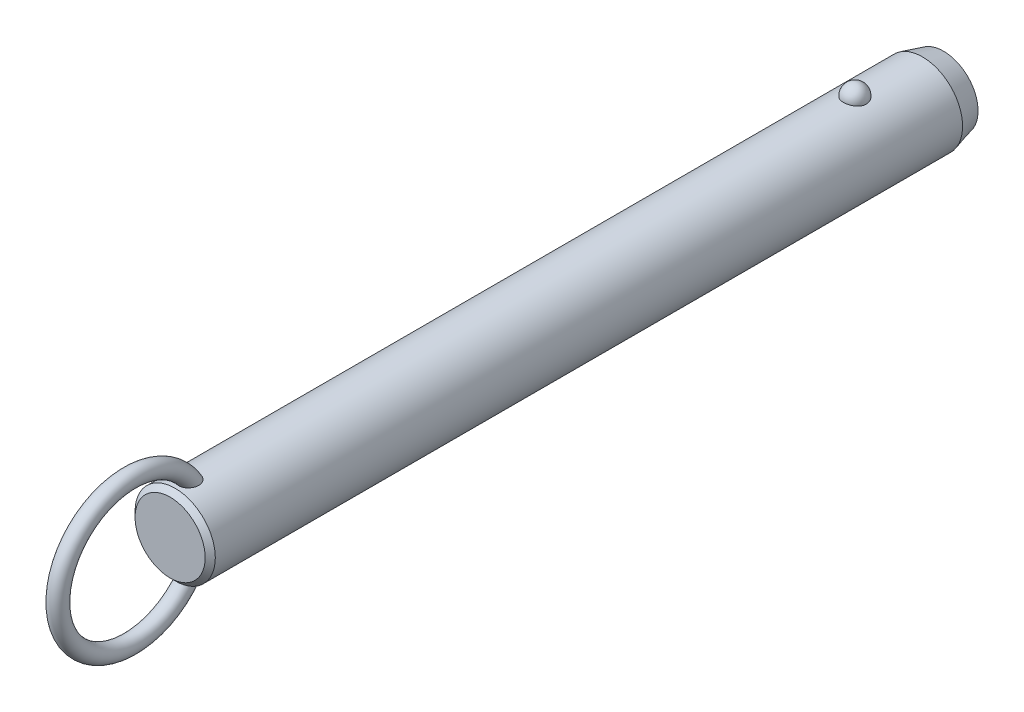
ISO-10303-21;
HEADER;
FILE_DESCRIPTION(('STEP AP214'),'2;1');
FILE_NAME('part.step','',(''),(''),'','','');
FILE_SCHEMA(('AUTOMOTIVE_DESIGN { 1 0 10303 214 1 1 1 1 }'));
ENDSEC;
DATA;
#1=APPLICATION_CONTEXT('core data for automotive mechanical design processes');
#2=APPLICATION_PROTOCOL_DEFINITION('international standard','automotive_design',2000,#1);
#3=PRODUCT_CONTEXT('',#1,'mechanical');
#4=PRODUCT('Part','Part','',(#3));
#5=PRODUCT_RELATED_PRODUCT_CATEGORY('part','',(#4));
#6=PRODUCT_DEFINITION_FORMATION('','',#4);
#7=PRODUCT_DEFINITION_CONTEXT('part definition',#1,'design');
#8=PRODUCT_DEFINITION('design','',#6,#7);
#9=PRODUCT_DEFINITION_SHAPE('','',#8);
#10=(LENGTH_UNIT() NAMED_UNIT(*) SI_UNIT(.MILLI.,.METRE.));
#11=(NAMED_UNIT(*) PLANE_ANGLE_UNIT() SI_UNIT($,.RADIAN.));
#12=(NAMED_UNIT(*) SI_UNIT($,.STERADIAN.) SOLID_ANGLE_UNIT());
#13=UNCERTAINTY_MEASURE_WITH_UNIT(LENGTH_MEASURE(1.E-05),#10,'distance_accuracy_value','');
#14=(GEOMETRIC_REPRESENTATION_CONTEXT(3) GLOBAL_UNCERTAINTY_ASSIGNED_CONTEXT((#13)) GLOBAL_UNIT_ASSIGNED_CONTEXT((#10,
#11,#12)) REPRESENTATION_CONTEXT('',''));
#15=CARTESIAN_POINT('',(0.,0.,0.));
#16=DIRECTION('',(0.,0.,1.));
#17=DIRECTION('',(1.,0.,0.));
#18=AXIS2_PLACEMENT_3D('',#15,#16,#17);
#19=CARTESIAN_POINT('',(0.,0.,149.9));
#20=DIRECTION('',(0.,0.,-1.));
#21=DIRECTION('',(-1.,0.,0.));
#22=AXIS2_PLACEMENT_3D('',#19,#20,#21);
#23=CYLINDRICAL_SURFACE('',#22,9.5);
#24=CARTESIAN_POINT('',(2.67259918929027,9.11631578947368,-2.70000000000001));
#25=CARTESIAN_POINT('',(2.6725968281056,9.11631786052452,-2.54909854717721));
#26=CARTESIAN_POINT('',(2.66030567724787,9.11994722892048,-2.39816735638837));
#27=CARTESIAN_POINT('',(2.6114347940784,9.13405924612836,-2.10058568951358));
#28=CARTESIAN_POINT('',(2.57484658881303,9.14454428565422,-1.95393672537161));
#29=CARTESIAN_POINT('',(2.47830875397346,9.17117631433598,-1.66916069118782));
#30=CARTESIAN_POINT('',(2.41836936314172,9.18732082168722,-1.53102991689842));
#31=CARTESIAN_POINT('',(2.27661331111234,9.22346780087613,-1.26705393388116));
#32=CARTESIAN_POINT('',(2.19479699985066,9.24347021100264,-1.14120852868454));
#33=CARTESIAN_POINT('',(2.01085282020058,9.28522401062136,-0.904632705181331));
#34=CARTESIAN_POINT('',(1.90862396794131,9.30698376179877,-0.793982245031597));
#35=CARTESIAN_POINT('',(1.6867437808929,9.34973971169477,-0.591607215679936));
#36=CARTESIAN_POINT('',(1.56709244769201,9.37073591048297,-0.499882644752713));
#37=CARTESIAN_POINT('',(1.31393976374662,9.40956370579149,-0.338167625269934));
#38=CARTESIAN_POINT('',(1.18048026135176,9.42740444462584,-0.268113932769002));
#39=CARTESIAN_POINT('',(0.903154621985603,9.45799906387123,-0.151390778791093));
#40=CARTESIAN_POINT('',(0.759289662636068,9.47075351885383,-0.104718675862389));
#41=CARTESIAN_POINT('',(0.468074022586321,9.48956256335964,-0.0367633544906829));
#42=CARTESIAN_POINT('',(0.320836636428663,9.49573643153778,-0.0150275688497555));
#43=CARTESIAN_POINT('',(0.0246714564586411,9.50112183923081,0.00396199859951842));
#44=CARTESIAN_POINT('',(-0.124256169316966,9.50033406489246,0.00121819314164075));
#45=CARTESIAN_POINT('',(-0.417264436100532,9.4919475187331,-0.0284441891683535));
#46=CARTESIAN_POINT('',(-0.56138413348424,9.48444885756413,-0.0550074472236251));
#47=CARTESIAN_POINT('',(-0.842986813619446,9.46357853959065,-0.131064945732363));
#48=CARTESIAN_POINT('',(-0.980469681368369,9.450206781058,-0.180559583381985));
#49=CARTESIAN_POINT('',(-1.24585005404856,9.41890822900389,-0.301476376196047));
#50=CARTESIAN_POINT('',(-1.37368611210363,9.40095498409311,-0.373026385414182));
#51=CARTESIAN_POINT('',(-1.61552738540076,9.36242964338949,-0.536025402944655));
#52=CARTESIAN_POINT('',(-1.72953116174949,9.34185727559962,-0.627476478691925));
#53=CARTESIAN_POINT('',(-1.9429225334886,9.29984568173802,-0.829844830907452));
#54=CARTESIAN_POINT('',(-2.04198021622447,9.27839736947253,-0.94110821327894));
#55=CARTESIAN_POINT('',(-2.22026460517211,9.23735994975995,-1.17883414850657));
#56=CARTESIAN_POINT('',(-2.29948985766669,9.21777097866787,-1.30529781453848));
#57=CARTESIAN_POINT('',(-2.43697287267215,9.18238994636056,-1.57158566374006));
#58=CARTESIAN_POINT('',(-2.49497068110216,9.16664569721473,-1.71155057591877));
#59=CARTESIAN_POINT('',(-2.5872073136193,9.14104303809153,-1.99961197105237));
#60=CARTESIAN_POINT('',(-2.62144683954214,9.13118445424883,-2.14770821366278));
#61=CARTESIAN_POINT('',(-2.66521466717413,9.11850622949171,-2.44715424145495));
#62=CARTESIAN_POINT('',(-2.67484831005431,9.11565658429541,-2.59848735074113));
#63=CARTESIAN_POINT('',(-2.66946735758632,9.11723375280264,-2.90067317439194));
#64=CARTESIAN_POINT('',(-2.65445345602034,9.12166036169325,-3.05152590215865));
#65=CARTESIAN_POINT('',(-2.60029711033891,9.13724422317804,-3.34766110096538));
#66=CARTESIAN_POINT('',(-2.56127978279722,9.14836656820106,-3.49296833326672));
#67=CARTESIAN_POINT('',(-2.46018844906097,9.17606676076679,-3.77477535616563));
#68=CARTESIAN_POINT('',(-2.39811349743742,9.1926448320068,-3.9112747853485));
#69=CARTESIAN_POINT('',(-2.25202303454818,9.22952198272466,-4.17244273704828));
#70=CARTESIAN_POINT('',(-2.16788714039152,9.24984129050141,-4.29704106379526));
#71=CARTESIAN_POINT('',(-1.9799408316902,9.29188255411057,-4.53013066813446));
#72=CARTESIAN_POINT('',(-1.87612963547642,9.31360456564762,-4.63862130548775));
#73=CARTESIAN_POINT('',(-1.65105429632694,9.35612959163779,-4.8369029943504));
#74=CARTESIAN_POINT('',(-1.52972405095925,9.37692871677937,-4.92661991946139));
#75=CARTESIAN_POINT('',(-1.27318250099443,9.41518970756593,-5.08429106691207));
#76=CARTESIAN_POINT('',(-1.13797219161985,9.432651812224,-5.15224684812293));
#77=CARTESIAN_POINT('',(-0.859280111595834,9.46208255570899,-5.26371827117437));
#78=CARTESIAN_POINT('',(-0.715925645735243,9.47411833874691,-5.30753421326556));
#79=CARTESIAN_POINT('',(-0.423550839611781,9.4916822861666,-5.37076321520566));
#80=CARTESIAN_POINT('',(-0.2745312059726,9.49721125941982,-5.39017930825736));
#81=CARTESIAN_POINT('',(0.0218446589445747,9.50110860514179,-5.40390587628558));
#82=CARTESIAN_POINT('',(0.16917707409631,9.49961381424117,-5.39869609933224));
#83=CARTESIAN_POINT('',(0.460808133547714,9.48993906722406,-5.36441955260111));
#84=CARTESIAN_POINT('',(0.605106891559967,9.48175936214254,-5.33535367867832));
#85=CARTESIAN_POINT('',(0.886027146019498,9.4596376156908,-5.25435587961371));
#86=CARTESIAN_POINT('',(1.02267710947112,9.44571881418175,-5.20251612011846));
#87=CARTESIAN_POINT('',(1.28523827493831,9.41358993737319,-5.07741549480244));
#88=CARTESIAN_POINT('',(1.41114877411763,9.39537958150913,-5.00415322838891));
#89=CARTESIAN_POINT('',(1.65085227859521,9.3562644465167,-4.83684599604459));
#90=CARTESIAN_POINT('',(1.76442346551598,9.33532178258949,-4.74249218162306));
#91=CARTESIAN_POINT('',(1.97425672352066,9.29321198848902,-4.53620389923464));
#92=CARTESIAN_POINT('',(2.07051582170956,9.27204482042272,-4.42426641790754));
#93=CARTESIAN_POINT('',(2.24490086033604,9.23139221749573,-4.18363183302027));
#94=CARTESIAN_POINT('',(2.32267019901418,9.21194380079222,-4.05466990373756));
#95=CARTESIAN_POINT('',(2.45584092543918,9.1773419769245,-3.78517836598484));
#96=CARTESIAN_POINT('',(2.5112497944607,9.16218713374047,-3.64465264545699));
#97=CARTESIAN_POINT('',(2.59380876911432,9.13913522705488,-3.37104301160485));
#98=CARTESIAN_POINT('',(2.62330266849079,9.13064624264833,-3.23871053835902));
#99=CARTESIAN_POINT('',(2.66269870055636,9.11923566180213,-2.97092664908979));
#100=CARTESIAN_POINT('',(2.67260130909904,9.11631393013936,-2.83547530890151));
#101=CARTESIAN_POINT('',(2.67259918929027,9.11631578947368,-2.70000000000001));
#102=B_SPLINE_CURVE_WITH_KNOTS('',3,(#24,#25,#26,#27,#28,#29,#30,#31,#32,#33,#34,#35,#36,#37,
#38,#39,#40,#41,#42,#43,#44,#45,#46,#47,#48,#49,#50,#51,#52,#53,#54,#55,#56,#57,#58,#59,#60,#61,
#62,#63,#64,#65,#66,#67,#68,#69,#70,#71,#72,#73,#74,#75,#76,#77,#78,#79,#80,#81,#82,#83,#84,#85,
#86,#87,#88,#89,#90,#91,#92,#93,#94,#95,#96,#97,#98,#99,#100,#101),.UNSPECIFIED.,.T.,.F.,(4,2,2,
2,2,2,2,2,2,2,2,2,2,2,2,2,2,2,2,2,2,2,2,2,2,2,2,2,2,2,2,2,2,2,2,2,2,2,4),(0.,0.452217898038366,
0.904593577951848,1.35677112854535,1.80894144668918,2.26340676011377,2.71787203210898,
3.17099820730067,3.62407318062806,4.0687883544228,4.51345969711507,4.95160616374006,
5.38976021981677,5.83050358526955,6.27129275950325,6.72071308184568,7.17016633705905,
7.62495278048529,8.07972578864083,8.53254856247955,8.98535859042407,9.43582813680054,
9.88631615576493,10.3393155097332,10.7923328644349,11.2471065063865,11.7018475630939,
12.150795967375,12.599688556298,13.0398725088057,13.4800399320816,13.9184421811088,
14.3568730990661,14.802202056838,15.2476074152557,15.7010097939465,16.1542603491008,
16.5602594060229,16.966248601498),.UNSPECIFIED.);
#103=CARTESIAN_POINT('',(2.67259918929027,9.11631578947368,-2.70000000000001));
#104=VERTEX_POINT('',#103);
#105=EDGE_CURVE('E41',#104,#104,#102,.T.);
#106=ORIENTED_EDGE('',*,*,#105,.T.);
#107=EDGE_LOOP('',(#106));
#108=FACE_BOUND('',#107,.T.);
#109=CARTESIAN_POINT('',(0.,0.,158.22));
#110=DIRECTION('',(0.,0.,1.));
#111=DIRECTION('',(1.,0.,0.));
#112=AXIS2_PLACEMENT_3D('',#109,#110,#111);
#113=CIRCLE('',#112,9.5);
#114=CARTESIAN_POINT('',(9.5,0.,158.22));
#115=VERTEX_POINT('',#114);
#116=EDGE_CURVE('E10',#115,#115,#113,.F.);
#117=ORIENTED_EDGE('',*,*,#116,.T.);
#118=EDGE_LOOP('',(#117));
#119=FACE_BOUND('',#118,.T.);
#120=CARTESIAN_POINT('',(-0.697062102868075,-9.47439269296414,152.567808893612));
#121=CARTESIAN_POINT('',(-0.799579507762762,-9.46685146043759,152.607482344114));
#122=CARTESIAN_POINT('',(-0.89857563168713,-9.45788043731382,152.6559309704));
#123=CARTESIAN_POINT('',(-1.08670047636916,-9.43811593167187,152.768868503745));
#124=CARTESIAN_POINT('',(-1.17583204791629,-9.42732297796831,152.833352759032));
#125=CARTESIAN_POINT('',(-1.34179806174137,-9.40513672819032,152.976209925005));
#126=CARTESIAN_POINT('',(-1.41865133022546,-9.39374438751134,153.054561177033));
#127=CARTESIAN_POINT('',(-1.5586004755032,-9.37154196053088,153.222752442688));
#128=CARTESIAN_POINT('',(-1.62169476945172,-9.3607319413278,153.31259377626));
#129=CARTESIAN_POINT('',(-1.73527695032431,-9.34035749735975,153.504500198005));
#130=CARTESIAN_POINT('',(-1.78522266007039,-9.33085270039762,153.606891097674));
#131=CARTESIAN_POINT('',(-1.86924997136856,-9.3143834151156,153.818148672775));
#132=CARTESIAN_POINT('',(-1.90332570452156,-9.30741986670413,153.927017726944));
#133=CARTESIAN_POINT('',(-1.95893603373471,-9.29588482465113,154.160473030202));
#134=CARTESIAN_POINT('',(-1.97872420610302,-9.29165182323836,154.285489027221));
#135=CARTESIAN_POINT('',(-2.00062129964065,-9.28695978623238,154.537080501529));
#136=CARTESIAN_POINT('',(-2.00272284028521,-9.28650232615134,154.663656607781));
#137=CARTESIAN_POINT('',(-1.98958876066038,-9.28932750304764,154.936815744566));
#138=CARTESIAN_POINT('',(-1.97143366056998,-9.2932400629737,155.083251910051));
#139=CARTESIAN_POINT('',(-1.91479925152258,-9.30507151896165,155.372062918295));
#140=CARTESIAN_POINT('',(-1.87629122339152,-9.31299607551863,155.514431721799));
#141=CARTESIAN_POINT('',(-1.7722568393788,-9.33340232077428,155.815172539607));
#142=CARTESIAN_POINT('',(-1.70334898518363,-9.34641636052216,155.972369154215));
#143=CARTESIAN_POINT('',(-1.58111062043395,-9.36759153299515,156.197517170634));
#144=CARTESIAN_POINT('',(-1.53721459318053,-9.37492619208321,156.270796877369));
#145=CARTESIAN_POINT('',(-1.44302631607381,-9.38988566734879,156.41307405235));
#146=CARTESIAN_POINT('',(-1.39273721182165,-9.39751033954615,156.482073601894));
#147=CARTESIAN_POINT('',(-1.26775962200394,-9.41530678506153,156.636983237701));
#148=CARTESIAN_POINT('',(-1.19052326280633,-9.42548108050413,156.720871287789));
#149=CARTESIAN_POINT('',(-1.02420241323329,-9.44499825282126,156.876008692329));
#150=CARTESIAN_POINT('',(-0.935139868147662,-9.45434261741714,156.947280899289));
#151=CARTESIAN_POINT('',(-0.766610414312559,-9.46930670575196,157.058695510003));
#152=CARTESIAN_POINT('',(-0.689439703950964,-9.47529223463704,157.102235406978));
#153=CARTESIAN_POINT('',(-0.528942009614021,-9.48560294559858,157.17631336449));
#154=CARTESIAN_POINT('',(-0.445620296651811,-9.48992953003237,157.206862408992));
#155=CARTESIAN_POINT('',(-0.273901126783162,-9.49644161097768,157.252579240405));
#156=CARTESIAN_POINT('',(-0.18546574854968,-9.49860811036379,157.26761059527));
#157=CARTESIAN_POINT('',(-0.00734541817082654,-9.5004135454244,157.280149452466));
#158=CARTESIAN_POINT('',(0.082338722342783,-9.50005405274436,157.277667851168));
#159=CARTESIAN_POINT('',(0.247679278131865,-9.49708301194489,157.256995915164));
#160=CARTESIAN_POINT('',(0.323620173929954,-9.49477609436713,157.240930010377));
#161=CARTESIAN_POINT('',(0.471981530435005,-9.48855917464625,157.197172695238));
#162=CARTESIAN_POINT('',(0.544400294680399,-9.48464840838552,157.169475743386));
#163=CARTESIAN_POINT('',(0.708947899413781,-9.47398336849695,157.09280266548));
#164=CARTESIAN_POINT('',(0.799149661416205,-9.46671310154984,157.039774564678));
#165=CARTESIAN_POINT('',(0.969783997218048,-9.45076225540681,156.919973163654));
#166=CARTESIAN_POINT('',(1.05019415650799,-9.44207854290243,156.853169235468));
#167=CARTESIAN_POINT('',(1.23092343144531,-9.42051459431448,156.680759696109));
#168=CARTESIAN_POINT('',(1.32652499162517,-9.40733378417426,156.57026193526));
#169=CARTESIAN_POINT('',(1.49893121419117,-9.38140745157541,156.335561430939));
#170=CARTESIAN_POINT('',(1.57571616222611,-9.36866239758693,156.211344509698));
#171=CARTESIAN_POINT('',(1.71285426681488,-9.34457644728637,155.949389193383));
#172=CARTESIAN_POINT('',(1.77266365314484,-9.33328726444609,155.81136233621));
#173=CARTESIAN_POINT('',(1.87239208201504,-9.31379209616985,155.528051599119));
#174=CARTESIAN_POINT('',(1.91230158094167,-9.30558759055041,155.382764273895));
#175=CARTESIAN_POINT('',(1.97604189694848,-9.29228394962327,155.062028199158));
#176=CARTESIAN_POINT('',(1.9958743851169,-9.28797202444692,154.885724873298));
#177=CARTESIAN_POINT('',(2.00295708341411,-9.28645519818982,154.532414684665));
#178=CARTESIAN_POINT('',(1.99025930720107,-9.28923895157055,154.355409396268));
#179=CARTESIAN_POINT('',(1.93735479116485,-9.30038134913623,154.056338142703));
#180=CARTESIAN_POINT('',(1.90576827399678,-9.30697680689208,153.932667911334));
#181=CARTESIAN_POINT('',(1.82287484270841,-9.32356855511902,153.692329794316));
#182=CARTESIAN_POINT('',(1.77158213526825,-9.33356239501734,153.575656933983));
#183=CARTESIAN_POINT('',(1.64885744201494,-9.35602275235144,153.352706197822));
#184=CARTESIAN_POINT('',(1.57730995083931,-9.36850332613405,153.246492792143));
#185=CARTESIAN_POINT('',(1.41543264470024,-9.39431873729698,153.049553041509));
#186=CARTESIAN_POINT('',(1.32510883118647,-9.40765330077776,152.958821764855));
#187=CARTESIAN_POINT('',(1.13846223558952,-9.43195720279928,152.805033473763));
#188=CARTESIAN_POINT('',(1.04369890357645,-9.44302894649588,152.740094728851));
#189=CARTESIAN_POINT('',(0.843965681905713,-9.46296805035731,152.628038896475));
#190=CARTESIAN_POINT('',(0.739000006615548,-9.47183631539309,152.580914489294));
#191=CARTESIAN_POINT('',(0.528175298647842,-9.48586140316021,152.508117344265));
#192=CARTESIAN_POINT('',(0.422686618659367,-9.49119633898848,152.48140249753));
#193=CARTESIAN_POINT('',(0.208590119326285,-9.49831365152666,152.446013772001));
#194=CARTESIAN_POINT('',(0.0999817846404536,-9.500095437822,152.437342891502));
#195=CARTESIAN_POINT('',(-0.126104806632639,-9.49988861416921,152.438350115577));
#196=CARTESIAN_POINT('',(-0.243578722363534,-9.49757821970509,152.449594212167));
#197=CARTESIAN_POINT('',(-0.474390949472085,-9.48885165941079,152.493167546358));
#198=CARTESIAN_POINT('',(-0.587729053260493,-9.48243528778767,152.525497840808));
#199=CARTESIAN_POINT('',(-0.697062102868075,-9.47439269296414,152.567808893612));
#200=B_SPLINE_CURVE_WITH_KNOTS('',3,(#120,#121,#122,#123,#124,#125,#126,#127,#128,#129,#130,
#131,#132,#133,#134,#135,#136,#137,#138,#139,#140,#141,#142,#143,#144,#145,#146,#147,#148,#149,
#150,#151,#152,#153,#154,#155,#156,#157,#158,#159,#160,#161,#162,#163,#164,#165,#166,#167,#168,
#169,#170,#171,#172,#173,#174,#175,#176,#177,#178,#179,#180,#181,#182,#183,#184,#185,#186,#187,
#188,#189,#190,#191,#192,#193,#194,#195,#196,#197,#198,#199),.UNSPECIFIED.,.T.,.F.,(4,2,2,2,2,2,
2,2,2,2,2,2,2,2,2,2,2,2,2,2,2,2,2,2,2,2,2,2,2,2,2,2,2,2,2,2,2,2,2,4),(0.,0.330119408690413,
0.6601431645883,0.98965593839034,1.31920659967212,1.66074728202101,2.00241415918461,
2.3808869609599,2.75951768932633,3.20065679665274,3.64242004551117,4.15620996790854,
4.4131416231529,4.66994734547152,5.01228664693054,5.35399933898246,5.61943037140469,
5.88463652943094,6.15215502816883,6.41950709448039,6.65144391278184,6.88349136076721,
7.19641200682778,7.51003602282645,7.94779711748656,8.3860149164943,8.83699707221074,
9.28819530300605,9.81778662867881,10.34653170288,10.7284172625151,11.1100280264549,
11.4938603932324,11.8775702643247,12.2220189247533,12.5663259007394,12.8915939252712,
13.2169159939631,13.5689650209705,13.9210316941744),.UNSPECIFIED.);
#201=CARTESIAN_POINT('',(-0.697062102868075,-9.47439269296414,152.567808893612));
#202=VERTEX_POINT('',#201);
#203=EDGE_CURVE('E60',#202,#202,#200,.T.);
#204=ORIENTED_EDGE('',*,*,#203,.T.);
#205=EDGE_LOOP('',(#204));
#206=FACE_BOUND('',#205,.T.);
#207=CARTESIAN_POINT('',(-0.697062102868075,9.47439269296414,152.567808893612));
#208=CARTESIAN_POINT('',(-0.597792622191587,9.48169483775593,152.52939564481));
#209=CARTESIAN_POINT('',(-0.495106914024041,9.48766580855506,152.499168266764));
#210=CARTESIAN_POINT('',(-0.285876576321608,9.49627648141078,152.456032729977));
#211=CARTESIAN_POINT('',(-0.179324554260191,9.49890941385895,152.443159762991));
#212=CARTESIAN_POINT('',(0.0344157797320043,9.50053798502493,152.435166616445));
#213=CARTESIAN_POINT('',(0.14160360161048,9.49953613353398,152.440034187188));
#214=CARTESIAN_POINT('',(0.353563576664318,9.49401038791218,152.467365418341));
#215=CARTESIAN_POINT('',(0.458336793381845,9.48948807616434,152.48982117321));
#216=CARTESIAN_POINT('',(0.662493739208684,9.4774236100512,152.551671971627));
#217=CARTESIAN_POINT('',(0.761881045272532,9.46988348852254,152.591055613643));
#218=CARTESIAN_POINT('',(0.952608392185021,9.45260382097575,152.685634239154));
#219=CARTESIAN_POINT('',(1.04394806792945,9.44286417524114,152.740829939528));
#220=CARTESIAN_POINT('',(1.21712767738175,9.42211760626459,152.866066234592));
#221=CARTESIAN_POINT('',(1.29885671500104,9.41109835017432,152.936257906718));
#222=CARTESIAN_POINT('',(1.44978975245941,9.38903310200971,153.088980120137));
#223=CARTESIAN_POINT('',(1.51899278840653,9.37798710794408,153.171511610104));
#224=CARTESIAN_POINT('',(1.64602857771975,9.35654375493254,153.349776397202));
#225=CARTESIAN_POINT('',(1.70333052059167,9.34618688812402,153.445891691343));
#226=CARTESIAN_POINT('',(1.80259341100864,9.32755128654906,153.645897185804));
#227=CARTESIAN_POINT('',(1.84454942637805,9.31927322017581,153.749789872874));
#228=CARTESIAN_POINT('',(1.91637039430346,9.30478365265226,153.972213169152));
#229=CARTESIAN_POINT('',(1.944805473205,9.29882552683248,154.091219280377));
#230=CARTESIAN_POINT('',(1.98449865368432,9.29043398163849,154.332143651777));
#231=CARTESIAN_POINT('',(1.99574908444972,9.28800213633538,154.454063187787));
#232=CARTESIAN_POINT('',(2.00275141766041,9.28649645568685,154.716932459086));
#233=CARTESIAN_POINT('',(1.99588238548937,9.28799035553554,154.857952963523));
#234=CARTESIAN_POINT('',(1.96270559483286,9.29505517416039,155.137621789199));
#235=CARTESIAN_POINT('',(1.93637872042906,9.30063010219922,155.276267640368));
#236=CARTESIAN_POINT('',(1.85949176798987,9.31633564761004,155.572561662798));
#237=CARTESIAN_POINT('',(1.80549792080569,9.3270926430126,155.729290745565));
#238=CARTESIAN_POINT('',(1.67376869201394,9.3516306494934,156.032284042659));
#239=CARTESIAN_POINT('',(1.59603181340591,9.36541185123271,156.178547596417));
#240=CARTESIAN_POINT('',(1.4360277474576,9.39110706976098,156.425813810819));
#241=CARTESIAN_POINT('',(1.35831795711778,9.40278656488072,156.529791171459));
#242=CARTESIAN_POINT('',(1.18774483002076,9.42585025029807,156.724534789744));
#243=CARTESIAN_POINT('',(1.09490932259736,9.43723493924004,156.815324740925));
#244=CARTESIAN_POINT('',(0.921110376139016,9.45552616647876,156.95620334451));
#245=CARTESIAN_POINT('',(0.843738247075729,9.46281058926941,157.010656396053));
#246=CARTESIAN_POINT('',(0.681245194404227,9.47589120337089,157.106711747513));
#247=CARTESIAN_POINT('',(0.596135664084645,9.48168953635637,157.148332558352));
#248=CARTESIAN_POINT('',(0.433779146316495,9.49038144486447,157.210089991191));
#249=CARTESIAN_POINT('',(0.35745955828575,9.49359170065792,157.23260136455));
#250=CARTESIAN_POINT('',(0.202074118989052,9.49816761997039,157.264574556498));
#251=CARTESIAN_POINT('',(0.123010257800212,9.49953459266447,157.274045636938));
#252=CARTESIAN_POINT('',(-0.0357372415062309,9.50026497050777,157.279114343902));
#253=CARTESIAN_POINT('',(-0.115421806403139,9.49962433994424,157.274684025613));
#254=CARTESIAN_POINT('',(-0.272823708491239,9.49640854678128,157.252296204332));
#255=CARTESIAN_POINT('',(-0.350540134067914,9.4938325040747,157.234332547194));
#256=CARTESIAN_POINT('',(-0.500580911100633,9.48709462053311,157.186802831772));
#257=CARTESIAN_POINT('',(-0.572979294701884,9.48296359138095,157.157461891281));
#258=CARTESIAN_POINT('',(-0.712864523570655,9.47347609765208,157.089008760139));
#259=CARTESIAN_POINT('',(-0.780349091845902,9.46811906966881,157.049892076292));
#260=CARTESIAN_POINT('',(-0.946309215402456,9.45329720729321,156.939432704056));
#261=CARTESIAN_POINT('',(-1.04090230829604,9.44321512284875,156.862329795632));
#262=CARTESIAN_POINT('',(-1.21661929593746,9.42219227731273,156.69409718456));
#263=CARTESIAN_POINT('',(-1.29770519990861,9.41124921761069,156.602929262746));
#264=CARTESIAN_POINT('',(-1.47319646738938,9.38563439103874,156.376162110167));
#265=CARTESIAN_POINT('',(-1.5620887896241,9.37102009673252,156.236289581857));
#266=CARTESIAN_POINT('',(-1.71623987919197,9.34401559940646,155.943950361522));
#267=CARTESIAN_POINT('',(-1.7814786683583,9.33162728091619,155.791473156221));
#268=CARTESIAN_POINT('',(-1.88853837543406,9.31055541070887,155.475647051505));
#269=CARTESIAN_POINT('',(-1.92998995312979,9.30193076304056,155.312168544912));
#270=CARTESIAN_POINT('',(-1.98590726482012,9.29015757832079,154.980526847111));
#271=CARTESIAN_POINT('',(-2.0004070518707,9.2870021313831,154.812369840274));
#272=CARTESIAN_POINT('',(-1.99964701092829,9.28716218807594,154.505080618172));
#273=CARTESIAN_POINT('',(-1.98908145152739,9.28945704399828,154.365936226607));
#274=CARTESIAN_POINT('',(-1.94566294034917,9.29865169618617,154.091153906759));
#275=CARTESIAN_POINT('',(-1.91282062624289,9.30554929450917,153.955514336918));
#276=CARTESIAN_POINT('',(-1.84582133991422,9.31898248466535,153.757802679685));
#277=CARTESIAN_POINT('',(-1.82038084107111,9.32400364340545,153.692583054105));
#278=CARTESIAN_POINT('',(-1.7635051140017,9.33492884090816,153.564903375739));
#279=CARTESIAN_POINT('',(-1.73207305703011,9.34083241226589,153.502441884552));
#280=CARTESIAN_POINT('',(-1.66324243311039,9.35333332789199,153.38094078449));
#281=CARTESIAN_POINT('',(-1.625842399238,9.35993084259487,153.321902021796));
#282=CARTESIAN_POINT('',(-1.54527678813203,9.37356864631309,153.207987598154));
#283=CARTESIAN_POINT('',(-1.50211241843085,9.38060884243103,153.153111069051));
#284=CARTESIAN_POINT('',(-1.37681147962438,9.40004442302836,153.009961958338));
#285=CARTESIAN_POINT('',(-1.28916358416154,9.41261047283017,152.926429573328));
#286=CARTESIAN_POINT('',(-1.09996826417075,9.43658180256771,152.777236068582));
#287=CARTESIAN_POINT('',(-0.998461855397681,9.44799034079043,152.711523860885));
#288=CARTESIAN_POINT('',(-0.860188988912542,9.46103017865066,152.6394367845));
#289=CARTESIAN_POINT('',(-0.828141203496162,9.46389141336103,152.623851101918));
#290=CARTESIAN_POINT('',(-0.763210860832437,9.46934915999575,152.594473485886));
#291=CARTESIAN_POINT('',(-0.730328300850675,9.47194567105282,152.580681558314));
#292=CARTESIAN_POINT('',(-0.697062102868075,9.47439269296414,152.567808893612));
#293=B_SPLINE_CURVE_WITH_KNOTS('',3,(#207,#208,#209,#210,#211,#212,#213,#214,#215,#216,#217,
#218,#219,#220,#221,#222,#223,#224,#225,#226,#227,#228,#229,#230,#231,#232,#233,#234,#235,#236,
#237,#238,#239,#240,#241,#242,#243,#244,#245,#246,#247,#248,#249,#250,#251,#252,#253,#254,#255,
#256,#257,#258,#259,#260,#261,#262,#263,#264,#265,#266,#267,#268,#269,#270,#271,#272,#273,#274,
#275,#276,#277,#278,#279,#280,#281,#282,#283,#284,#285,#286,#287,#288,#289,#290,#291,#292),
.UNSPECIFIED.,.T.,.F.,(4,2,2,2,2,2,2,2,2,2,2,2,2,2,2,2,2,2,2,2,2,2,2,2,2,2,2,2,2,2,2,2,2,2,2,2,
2,2,2,2,2,2,4),(0.,0.319942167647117,0.640532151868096,0.960900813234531,1.28112555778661,
1.60113495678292,1.92115886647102,2.24457323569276,2.56801248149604,2.90371927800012,
3.23953387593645,3.60560313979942,3.97183576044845,4.39383693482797,4.81625324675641,
5.31257045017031,5.80891895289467,6.19868344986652,6.58773876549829,6.87145417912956,
7.15475838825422,7.3926375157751,7.63034760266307,7.86853584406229,8.10683246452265,
8.34063661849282,8.57454843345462,8.93983939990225,9.30614105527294,9.80266668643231,
10.2996107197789,10.8040753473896,11.3079021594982,11.7249776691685,12.1418541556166,
12.3521485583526,12.5623319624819,12.7725671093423,12.9827582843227,13.345827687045,
13.7078449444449,13.8150604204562,13.9222762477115),.UNSPECIFIED.);
#294=CARTESIAN_POINT('',(-0.697062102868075,9.47439269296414,152.567808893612));
#295=VERTEX_POINT('',#294);
#296=EDGE_CURVE('E67',#295,#295,#293,.T.);
#297=ORIENTED_EDGE('',*,*,#296,.T.);
#298=EDGE_LOOP('',(#297));
#299=FACE_BOUND('',#298,.T.);
#300=CARTESIAN_POINT('',(0.,0.,-18.6999999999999));
#301=DIRECTION('',(0.,0.,-1.));
#302=DIRECTION('',(-1.,0.,0.));
#303=AXIS2_PLACEMENT_3D('',#300,#301,#302);
#304=CIRCLE('',#303,9.5);
#305=CARTESIAN_POINT('',(-9.5,0.,-18.6999999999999));
#306=VERTEX_POINT('',#305);
#307=EDGE_CURVE('E57',#306,#306,#304,.F.);
#308=ORIENTED_EDGE('',*,*,#307,.T.);
#309=EDGE_LOOP('',(#308));
#310=FACE_BOUND('',#309,.T.);
#311=ADVANCED_FACE('F37',(#108,#119,#206,#299,#310),#23,.T.);
#312=CARTESIAN_POINT('',(0.,0.,-23.7));
#313=DIRECTION('',(0.,0.,-1.));
#314=DIRECTION('',(-1.,0.,0.));
#315=AXIS2_PLACEMENT_3D('',#312,#313,#314);
#316=PLANE('',#315);
#317=CARTESIAN_POINT('',(0.,0.,-23.7));
#318=DIRECTION('',(0.,0.,-1.));
#319=DIRECTION('',(-1.,0.,0.));
#320=AXIS2_PLACEMENT_3D('',#317,#318,#319);
#321=CIRCLE('',#320,8.16025403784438);
#322=CARTESIAN_POINT('',(-8.16025403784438,0.,-23.7));
#323=VERTEX_POINT('',#322);
#324=EDGE_CURVE('E66',#323,#323,#321,.T.);
#325=ORIENTED_EDGE('',*,*,#324,.T.);
#326=EDGE_LOOP('',(#325));
#327=FACE_BOUND('',#326,.T.);
#328=ADVANCED_FACE('F85',(#327),#316,.T.);
#329=CARTESIAN_POINT('',(0.,0.,-23.7));
#330=DIRECTION('',(0.,0.,1.));
#331=DIRECTION('',(1.,0.,0.));
#332=AXIS2_PLACEMENT_3D('',#329,#330,#331);
#333=CONICAL_SURFACE('',#332,8.16025403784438,0.261799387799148);
#334=ORIENTED_EDGE('',*,*,#307,.F.);
#335=EDGE_LOOP('',(#334));
#336=FACE_BOUND('',#335,.T.);
#337=ORIENTED_EDGE('',*,*,#324,.F.);
#338=EDGE_LOOP('',(#337));
#339=FACE_BOUND('',#338,.T.);
#340=ADVANCED_FACE('F83',(#336,#339),#333,.T.);
#341=CARTESIAN_POINT('',(0.,0.,159.42));
#342=DIRECTION('',(0.,0.,1.));
#343=DIRECTION('',(1.,0.,0.));
#344=AXIS2_PLACEMENT_3D('',#341,#342,#343);
#345=PLANE('',#344);
#346=CARTESIAN_POINT('',(0.,0.,159.42));
#347=DIRECTION('',(0.,0.,1.));
#348=DIRECTION('',(1.,0.,0.));
#349=AXIS2_PLACEMENT_3D('',#346,#347,#348);
#350=CIRCLE('',#349,8.3);
#351=CARTESIAN_POINT('',(8.3,0.,159.42));
#352=VERTEX_POINT('',#351);
#353=EDGE_CURVE('E50',#352,#352,#350,.T.);
#354=ORIENTED_EDGE('',*,*,#353,.T.);
#355=EDGE_LOOP('',(#354));
#356=FACE_BOUND('',#355,.T.);
#357=ADVANCED_FACE('F77',(#356),#345,.T.);
#358=CARTESIAN_POINT('',(0.,0.,168.95));
#359=DIRECTION('',(1.,0.,0.));
#360=DIRECTION('',(0.,0.,-1.));
#361=AXIS2_PLACEMENT_3D('',#358,#359,#360);
#362=TOROIDAL_SURFACE('',#361,17.05,2.);
#363=ORIENTED_EDGE('',*,*,#296,.F.);
#364=EDGE_LOOP('',(#363));
#365=FACE_BOUND('',#364,.T.);
#366=ORIENTED_EDGE('',*,*,#203,.F.);
#367=EDGE_LOOP('',(#366));
#368=FACE_BOUND('',#367,.T.);
#369=ADVANCED_FACE('F73',(#365,#368),#362,.T.);
#370=CARTESIAN_POINT('',(0.,0.,159.42));
#371=DIRECTION('',(0.,0.,-1.));
#372=DIRECTION('',(-1.,0.,0.));
#373=AXIS2_PLACEMENT_3D('',#370,#371,#372);
#374=CONICAL_SURFACE('',#373,8.3,0.785398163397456);
#375=ORIENTED_EDGE('',*,*,#116,.F.);
#376=EDGE_LOOP('',(#375));
#377=FACE_BOUND('',#376,.T.);
#378=ORIENTED_EDGE('',*,*,#353,.F.);
#379=EDGE_LOOP('',(#378));
#380=FACE_BOUND('',#379,.T.);
#381=ADVANCED_FACE('F39',(#377,#380),#374,.T.);
#382=CARTESIAN_POINT('',(0.,9.5,-2.70000000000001));
#383=DIRECTION('',(0.,1.,0.));
#384=DIRECTION('',(0.,0.,-1.));
#385=AXIS2_PLACEMENT_3D('',#382,#383,#384);
#386=SPHERICAL_SURFACE('',#385,2.7);
#387=ORIENTED_EDGE('',*,*,#105,.F.);
#388=EDGE_LOOP('',(#387));
#389=FACE_BOUND('',#388,.T.);
#390=ADVANCED_FACE('F79',(#389),#386,.T.);
#391=CLOSED_SHELL('',(#311,#328,#340,#357,#369,#381,#390));
#392=MANIFOLD_SOLID_BREP('B2',#391);
#393=ADVANCED_BREP_SHAPE_REPRESENTATION('',(#18,#392),#14);
#394=SHAPE_DEFINITION_REPRESENTATION(#9,#393);
ENDSEC;
END-ISO-10303-21;
